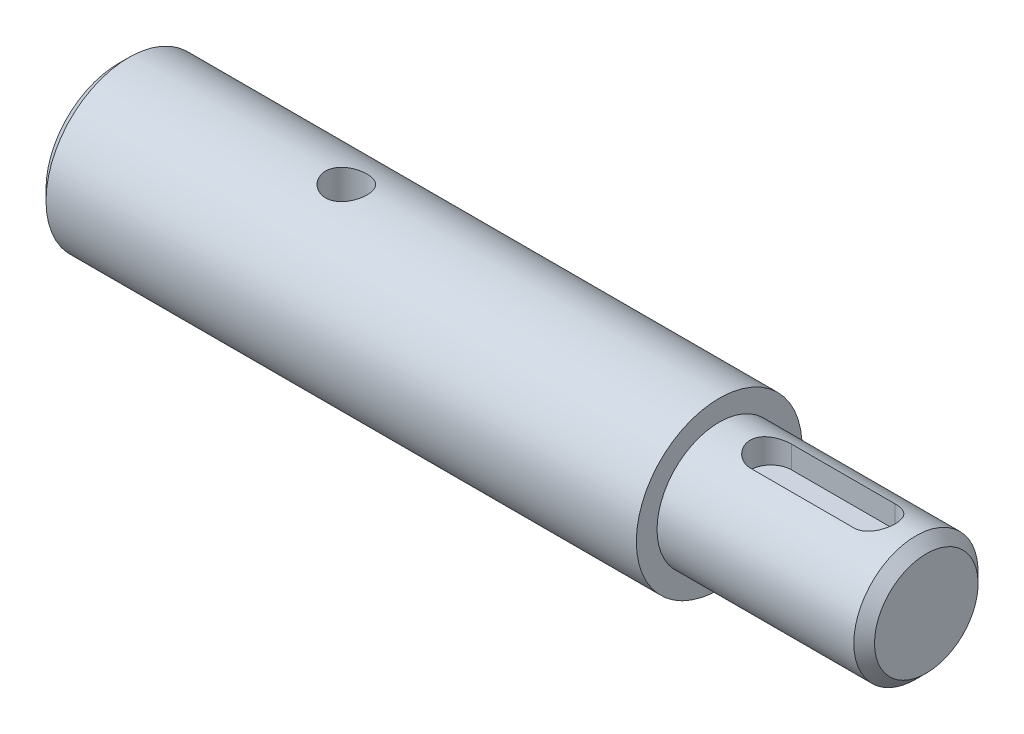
ISO-10303-21;
HEADER;
FILE_DESCRIPTION(('STEP AP214'),'2;1');
FILE_NAME('part.step','',(''),(''),'','','');
FILE_SCHEMA(('AUTOMOTIVE_DESIGN { 1 0 10303 214 1 1 1 1 }'));
ENDSEC;
DATA;
#1=APPLICATION_CONTEXT('core data for automotive mechanical design processes');
#2=APPLICATION_PROTOCOL_DEFINITION('international standard','automotive_design',2000,#1);
#3=PRODUCT_CONTEXT('',#1,'mechanical');
#4=PRODUCT('Part','Part','',(#3));
#5=PRODUCT_RELATED_PRODUCT_CATEGORY('part','',(#4));
#6=PRODUCT_DEFINITION_FORMATION('','',#4);
#7=PRODUCT_DEFINITION_CONTEXT('part definition',#1,'design');
#8=PRODUCT_DEFINITION('design','',#6,#7);
#9=PRODUCT_DEFINITION_SHAPE('','',#8);
#10=(LENGTH_UNIT() NAMED_UNIT(*) SI_UNIT(.MILLI.,.METRE.));
#11=(NAMED_UNIT(*) PLANE_ANGLE_UNIT() SI_UNIT($,.RADIAN.));
#12=(NAMED_UNIT(*) SI_UNIT($,.STERADIAN.) SOLID_ANGLE_UNIT());
#13=UNCERTAINTY_MEASURE_WITH_UNIT(LENGTH_MEASURE(1.E-05),#10,'distance_accuracy_value','');
#14=(GEOMETRIC_REPRESENTATION_CONTEXT(3) GLOBAL_UNCERTAINTY_ASSIGNED_CONTEXT((#13)) GLOBAL_UNIT_ASSIGNED_CONTEXT((#10,
#11,#12)) REPRESENTATION_CONTEXT('',''));
#15=CARTESIAN_POINT('',(0.,0.,0.));
#16=DIRECTION('',(0.,0.,1.));
#17=DIRECTION('',(1.,0.,0.));
#18=AXIS2_PLACEMENT_3D('',#15,#16,#17);
#19=CARTESIAN_POINT('',(0.,0.,0.));
#20=DIRECTION('',(-1.,0.,0.));
#21=DIRECTION('',(0.,0.,1.));
#22=AXIS2_PLACEMENT_3D('',#19,#20,#21);
#23=CYLINDRICAL_SURFACE('',#22,8.);
#24=CARTESIAN_POINT('',(58.,0.,0.));
#25=DIRECTION('',(-1.,0.,0.));
#26=DIRECTION('',(0.,0.,1.));
#27=AXIS2_PLACEMENT_3D('',#24,#25,#26);
#28=CIRCLE('',#27,8.);
#29=CARTESIAN_POINT('',(58.,0.,8.00000000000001));
#30=VERTEX_POINT('',#29);
#31=EDGE_CURVE('E111',#30,#30,#28,.T.);
#32=ORIENTED_EDGE('',*,*,#31,.T.);
#33=EDGE_LOOP('',(#32));
#34=FACE_BOUND('',#33,.T.);
#35=CARTESIAN_POINT('',(1.,0.,0.));
#36=DIRECTION('',(-1.,0.,0.));
#37=DIRECTION('',(0.,0.,1.));
#38=AXIS2_PLACEMENT_3D('',#35,#36,#37);
#39=CIRCLE('',#38,8.);
#40=CARTESIAN_POINT('',(1.,0.,8.00000000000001));
#41=VERTEX_POINT('',#40);
#42=EDGE_CURVE('E114',#41,#41,#39,.T.);
#43=ORIENTED_EDGE('',*,*,#42,.F.);
#44=EDGE_LOOP('',(#43));
#45=FACE_BOUND('',#44,.T.);
#46=CARTESIAN_POINT('',(22.,7.74596669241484,-2.00000000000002));
#47=CARTESIAN_POINT('',(21.8895593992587,7.74596880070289,-1.99999686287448));
#48=CARTESIAN_POINT('',(21.7790840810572,7.74835444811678,-1.99082099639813));
#49=CARTESIAN_POINT('',(21.5613059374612,7.75761489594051,-1.95441850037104));
#50=CARTESIAN_POINT('',(21.4540049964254,7.76449230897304,-1.9271813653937));
#51=CARTESIAN_POINT('',(21.2457571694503,7.78190979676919,-1.85559295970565));
#52=CARTESIAN_POINT('',(21.1448022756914,7.79244514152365,-1.81126378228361));
#53=CARTESIAN_POINT('',(20.9517513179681,7.81598553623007,-1.70681691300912));
#54=CARTESIAN_POINT('',(20.8596556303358,7.82899069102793,-1.64669855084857));
#55=CARTESIAN_POINT('',(20.6849106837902,7.85632573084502,-1.51096674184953));
#56=CARTESIAN_POINT('',(20.6024851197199,7.87067678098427,-1.43506951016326));
#57=CARTESIAN_POINT('',(20.4513908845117,7.89890300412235,-1.27054565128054));
#58=CARTESIAN_POINT('',(20.3827234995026,7.91277813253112,-1.18191783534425));
#59=CARTESIAN_POINT('',(20.260179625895,7.93872332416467,-0.992916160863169));
#60=CARTESIAN_POINT('',(20.2065228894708,7.95076549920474,-0.892395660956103));
#61=CARTESIAN_POINT('',(20.1169522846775,7.97144649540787,-0.683410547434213));
#62=CARTESIAN_POINT('',(20.0810357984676,7.98008581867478,-0.574947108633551));
#63=CARTESIAN_POINT('',(20.0286817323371,7.99283807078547,-0.355487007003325));
#64=CARTESIAN_POINT('',(20.0118642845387,7.99703915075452,-0.244586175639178));
#65=CARTESIAN_POINT('',(19.9969932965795,8.00074875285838,-0.0214630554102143));
#66=CARTESIAN_POINT('',(19.9989369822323,8.00025796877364,0.0907590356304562));
#67=CARTESIAN_POINT('',(20.0212598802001,7.99470475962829,0.310704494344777));
#68=CARTESIAN_POINT('',(20.0412290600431,7.989744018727,0.418472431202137));
#69=CARTESIAN_POINT('',(20.0983770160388,7.97592669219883,0.629076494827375));
#70=CARTESIAN_POINT('',(20.1355567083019,7.96706989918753,0.731912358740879));
#71=CARTESIAN_POINT('',(20.2264020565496,7.94630007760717,0.930813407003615));
#72=CARTESIAN_POINT('',(20.2802136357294,7.93436015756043,1.02680901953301));
#73=CARTESIAN_POINT('',(20.402684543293,7.90871923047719,1.20855124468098));
#74=CARTESIAN_POINT('',(20.4713464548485,7.89501791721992,1.29429607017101));
#75=CARTESIAN_POINT('',(20.6237669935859,7.86690971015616,1.45554807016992));
#76=CARTESIAN_POINT('',(20.7078839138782,7.85249375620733,1.5307153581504));
#77=CARTESIAN_POINT('',(20.8876799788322,7.82492034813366,1.66595275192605));
#78=CARTESIAN_POINT('',(20.9833596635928,7.81176295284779,1.72602215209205));
#79=CARTESIAN_POINT('',(21.1842320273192,7.78816397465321,1.82957625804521));
#80=CARTESIAN_POINT('',(21.2894685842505,7.77773586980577,1.87297913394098));
#81=CARTESIAN_POINT('',(21.5060683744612,7.76094912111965,1.94137124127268));
#82=CARTESIAN_POINT('',(21.6174302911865,7.75458960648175,1.96636441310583));
#83=CARTESIAN_POINT('',(21.8399676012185,7.74684284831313,1.99666371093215));
#84=CARTESIAN_POINT('',(21.9510702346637,7.74532871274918,2.0024723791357));
#85=CARTESIAN_POINT('',(22.1726575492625,7.74709874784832,1.99561359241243));
#86=CARTESIAN_POINT('',(22.283142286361,7.75038247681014,1.98294783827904));
#87=CARTESIAN_POINT('',(22.4984914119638,7.76125665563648,1.93994037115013));
#88=CARTESIAN_POINT('',(22.6034181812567,7.76877576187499,1.90989125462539));
#89=CARTESIAN_POINT('',(22.8067451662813,7.78720574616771,1.83329446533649));
#90=CARTESIAN_POINT('',(22.9051446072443,7.79811702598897,1.78674483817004));
#91=CARTESIAN_POINT('',(23.0947530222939,7.82236909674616,1.67741653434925));
#92=CARTESIAN_POINT('',(23.1857830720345,7.83575334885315,1.61433740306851));
#93=CARTESIAN_POINT('',(23.3561506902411,7.86333666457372,1.47412058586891));
#94=CARTESIAN_POINT('',(23.43548633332,7.87753586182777,1.39698058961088));
#95=CARTESIAN_POINT('',(23.5822488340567,7.90557922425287,1.22852544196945));
#96=CARTESIAN_POINT('',(23.649328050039,7.91940561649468,1.13690390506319));
#97=CARTESIAN_POINT('',(23.767148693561,7.94477773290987,0.943405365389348));
#98=CARTESIAN_POINT('',(23.8178909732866,7.9563235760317,0.841528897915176));
#99=CARTESIAN_POINT('',(23.9011568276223,7.97576092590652,0.631116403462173));
#100=CARTESIAN_POINT('',(23.9338114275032,7.98367864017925,0.522634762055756));
#101=CARTESIAN_POINT('',(23.9803682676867,7.99508234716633,0.301499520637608));
#102=CARTESIAN_POINT('',(23.9942741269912,7.99856919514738,0.188846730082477));
#103=CARTESIAN_POINT('',(24.0027351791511,8.00068338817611,-0.0341670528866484));
#104=CARTESIAN_POINT('',(23.9978034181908,7.99943957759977,-0.144507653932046));
#105=CARTESIAN_POINT('',(23.9699043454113,7.99251792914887,-0.362734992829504));
#106=CARTESIAN_POINT('',(23.9469375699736,7.98684022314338,-0.470621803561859));
#107=CARTESIAN_POINT('',(23.8838955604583,7.97170865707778,-0.68034207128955));
#108=CARTESIAN_POINT('',(23.8439130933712,7.96227529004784,-0.782204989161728));
#109=CARTESIAN_POINT('',(23.7480588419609,7.94062577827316,-0.977834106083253));
#110=CARTESIAN_POINT('',(23.692185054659,7.92840928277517,-1.07159928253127));
#111=CARTESIAN_POINT('',(23.5645695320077,7.90214499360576,-1.25080385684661));
#112=CARTESIAN_POINT('',(23.4924797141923,7.8880603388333,-1.33598997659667));
#113=CARTESIAN_POINT('',(23.3351542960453,7.85981298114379,-1.49323004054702));
#114=CARTESIAN_POINT('',(23.2499153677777,7.84565025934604,-1.5652806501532));
#115=CARTESIAN_POINT('',(23.0667971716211,7.81854951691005,-1.69552405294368));
#116=CARTESIAN_POINT('',(22.9687117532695,7.80563927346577,-1.75343323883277));
#117=CARTESIAN_POINT('',(22.7638890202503,7.78287910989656,-1.85185379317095));
#118=CARTESIAN_POINT('',(22.6571580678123,7.77302696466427,-1.89237781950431));
#119=CARTESIAN_POINT('',(22.4588459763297,7.75903817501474,-1.94884505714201));
#120=CARTESIAN_POINT('',(22.3682136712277,7.75417326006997,-1.96798634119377));
#121=CARTESIAN_POINT('',(22.1850622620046,7.7476367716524,-1.99356458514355));
#122=CARTESIAN_POINT('',(22.0925433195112,7.74596492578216,-2.00000262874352));
#123=CARTESIAN_POINT('',(22.,7.74596669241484,-2.00000000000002));
#124=B_SPLINE_CURVE_WITH_KNOTS('',3,(#46,#47,#48,#49,#50,#51,#52,#53,#54,#55,#56,#57,#58,#59,
#60,#61,#62,#63,#64,#65,#66,#67,#68,#69,#70,#71,#72,#73,#74,#75,#76,#77,#78,#79,#80,#81,#82,#83,
#84,#85,#86,#87,#88,#89,#90,#91,#92,#93,#94,#95,#96,#97,#98,#99,#100,#101,#102,#103,#104,#105,
#106,#107,#108,#109,#110,#111,#112,#113,#114,#115,#116,#117,#118,#119,#120,#121,#122,#123),
.UNSPECIFIED.,.T.,.F.,(4,2,2,2,2,2,2,2,2,2,2,2,2,2,2,2,2,2,2,2,2,2,2,2,2,2,2,2,2,2,2,2,2,2,2,2,
2,2,4),(0.,0.330981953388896,0.662156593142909,0.992904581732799,1.32366661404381,
1.66099163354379,1.99834817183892,2.34041197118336,2.68242527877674,3.01751000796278,
3.35254518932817,3.68014610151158,4.00776445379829,4.33834299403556,4.66897908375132,
5.0085637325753,5.34816424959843,5.68941145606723,6.0305856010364,6.36274859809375,
6.69488101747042,7.02157924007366,7.34831617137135,7.68146276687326,8.01466415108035,
8.35620264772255,8.69772332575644,9.03673658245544,9.37568439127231,9.70546756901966,
10.0352409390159,10.3632390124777,10.6912784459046,11.0271767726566,11.3631602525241,
11.7054118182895,12.0474137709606,12.3247826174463,12.6021278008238),.UNSPECIFIED.);
#125=CARTESIAN_POINT('',(22.,7.74596669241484,-2.00000000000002));
#126=VERTEX_POINT('',#125);
#127=EDGE_CURVE('E29',#126,#126,#124,.T.);
#128=ORIENTED_EDGE('',*,*,#127,.F.);
#129=EDGE_LOOP('',(#128));
#130=FACE_BOUND('',#129,.T.);
#131=ADVANCED_FACE('F25',(#34,#45,#130),#23,.T.);
#132=CARTESIAN_POINT('',(0.,0.,0.));
#133=DIRECTION('',(-1.,0.,0.));
#134=DIRECTION('',(0.,0.,1.));
#135=AXIS2_PLACEMENT_3D('',#132,#133,#134);
#136=CYLINDRICAL_SURFACE('',#135,6.);
#137=CARTESIAN_POINT('',(77.,0.,0.));
#138=DIRECTION('',(-1.,0.,0.));
#139=DIRECTION('',(0.,0.,1.));
#140=AXIS2_PLACEMENT_3D('',#137,#138,#139);
#141=CIRCLE('',#140,6.);
#142=CARTESIAN_POINT('',(77.,0.,6.));
#143=VERTEX_POINT('',#142);
#144=EDGE_CURVE('E105',#143,#143,#141,.T.);
#145=ORIENTED_EDGE('',*,*,#144,.T.);
#146=EDGE_LOOP('',(#145));
#147=FACE_BOUND('',#146,.T.);
#148=CARTESIAN_POINT('',(58.,0.,0.));
#149=DIRECTION('',(-1.,0.,0.));
#150=DIRECTION('',(0.,0.,1.));
#151=AXIS2_PLACEMENT_3D('',#148,#149,#150);
#152=CIRCLE('',#151,6.);
#153=CARTESIAN_POINT('',(58.,0.,6.00000000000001));
#154=VERTEX_POINT('',#153);
#155=EDGE_CURVE('E108',#154,#154,#152,.T.);
#156=ORIENTED_EDGE('',*,*,#155,.F.);
#157=EDGE_LOOP('',(#156));
#158=FACE_BOUND('',#157,.T.);
#159=DIRECTION('',(-1.,0.,0.));
#160=VECTOR('',#159,1.);
#161=CARTESIAN_POINT('',(0.,5.65685424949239,2.00000000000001));
#162=LINE('',#161,#160);
#163=CARTESIAN_POINT('',(63.,5.6568542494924,1.99999999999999));
#164=VERTEX_POINT('',#163);
#165=CARTESIAN_POINT('',(73.,5.6568542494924,1.99999999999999));
#166=VERTEX_POINT('',#165);
#167=EDGE_CURVE('E11',#164,#166,#162,.F.);
#168=ORIENTED_EDGE('',*,*,#167,.F.);
#169=CARTESIAN_POINT('',(63.,5.65685424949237,-2.00000000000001));
#170=CARTESIAN_POINT('',(62.8910636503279,5.65685389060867,-2.00000051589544));
#171=CARTESIAN_POINT('',(62.7821304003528,5.66003538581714,-1.99106956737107));
#172=CARTESIAN_POINT('',(62.5674911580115,5.67235148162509,-1.95570226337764));
#173=CARTESIAN_POINT('',(62.4617857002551,5.68148706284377,-1.92926302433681));
#174=CARTESIAN_POINT('',(62.2567462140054,5.70456407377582,-1.85991097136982));
#175=CARTESIAN_POINT('',(62.1574001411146,5.71849607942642,-1.81703044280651));
#176=CARTESIAN_POINT('',(61.9672799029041,5.74958244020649,-1.71612325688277));
#177=CARTESIAN_POINT('',(61.8765076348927,5.76673750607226,-1.65809325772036));
#178=CARTESIAN_POINT('',(61.7025600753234,5.80308978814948,-1.52610229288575));
#179=CARTESIAN_POINT('',(61.6197691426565,5.82233789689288,-1.45164868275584));
#180=CARTESIAN_POINT('',(61.4675863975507,5.86027729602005,-1.2899753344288));
#181=CARTESIAN_POINT('',(61.3981967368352,5.87896849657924,-1.20275355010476));
#182=CARTESIAN_POINT('',(61.2730422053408,5.91427733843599,-1.01520901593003));
#183=CARTESIAN_POINT('',(61.2176800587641,5.93082815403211,-0.914603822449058));
#184=CARTESIAN_POINT('',(61.124816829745,5.95939173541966,-0.704862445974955));
#185=CARTESIAN_POINT('',(61.0873109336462,5.97140572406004,-0.595728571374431));
#186=CARTESIAN_POINT('',(61.0325282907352,5.98918150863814,-0.376057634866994));
#187=CARTESIAN_POINT('',(61.014593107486,5.99514629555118,-0.265701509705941));
#188=CARTESIAN_POINT('',(60.9973674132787,6.00087216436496,-0.0433957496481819));
#189=CARTESIAN_POINT('',(60.9980720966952,6.00063484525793,0.0685534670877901));
#190=CARTESIAN_POINT('',(61.0176885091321,5.99412079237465,0.286207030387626));
#191=CARTESIAN_POINT('',(61.035885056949,5.98808129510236,0.391984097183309));
#192=CARTESIAN_POINT('',(61.0887859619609,5.97093934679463,0.598886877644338));
#193=CARTESIAN_POINT('',(61.1234914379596,5.95983655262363,0.700012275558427));
#194=CARTESIAN_POINT('',(61.2088426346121,5.93351340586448,0.896304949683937));
#195=CARTESIAN_POINT('',(61.259691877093,5.91824085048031,0.991376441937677));
#196=CARTESIAN_POINT('',(61.3757194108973,5.88516786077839,1.17184865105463));
#197=CARTESIAN_POINT('',(61.4409016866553,5.86736672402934,1.25724666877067));
#198=CARTESIAN_POINT('',(61.5873487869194,5.83012383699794,1.42020173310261));
#199=CARTESIAN_POINT('',(61.669226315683,5.81064430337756,1.49720031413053));
#200=CARTESIAN_POINT('',(61.8448974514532,5.77294670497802,1.63655451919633));
#201=CARTESIAN_POINT('',(61.9386928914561,5.75472883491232,1.69890788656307));
#202=CARTESIAN_POINT('',(62.1373072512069,5.72141050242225,1.80797491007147));
#203=CARTESIAN_POINT('',(62.2422642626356,5.70635818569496,1.85445292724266));
#204=CARTESIAN_POINT('',(62.4591427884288,5.6816330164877,1.92888638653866));
#205=CARTESIAN_POINT('',(62.5710613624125,5.67195790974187,1.95684959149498));
#206=CARTESIAN_POINT('',(62.7932767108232,5.65959272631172,1.99232256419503));
#207=CARTESIAN_POINT('',(62.9034188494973,5.65660720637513,2.00069819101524));
#208=CARTESIAN_POINT('',(63.1235522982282,5.65713344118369,1.99921087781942));
#209=CARTESIAN_POINT('',(63.233543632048,5.6606440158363,1.98935125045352));
#210=CARTESIAN_POINT('',(63.4463139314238,5.673472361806,1.95245130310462));
#211=CARTESIAN_POINT('',(63.5492108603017,5.68258650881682,1.92601278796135));
#212=CARTESIAN_POINT('',(63.7490872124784,5.70537107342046,1.85742772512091));
#213=CARTESIAN_POINT('',(63.8460655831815,5.71904229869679,1.81527839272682));
#214=CARTESIAN_POINT('',(64.034760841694,5.74993755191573,1.71494868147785));
#215=CARTESIAN_POINT('',(64.1262132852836,5.76726051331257,1.65630223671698));
#216=CARTESIAN_POINT('',(64.2982921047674,5.80331537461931,1.52517126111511));
#217=CARTESIAN_POINT('',(64.3789152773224,5.82204768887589,1.45268265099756));
#218=CARTESIAN_POINT('',(64.5310559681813,5.85990077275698,1.29178341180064));
#219=CARTESIAN_POINT('',(64.6019487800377,5.87899687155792,1.20277454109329));
#220=CARTESIAN_POINT('',(64.7278322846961,5.91453703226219,1.01365458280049));
#221=CARTESIAN_POINT('',(64.7828235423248,5.93098118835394,0.913543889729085));
#222=CARTESIAN_POINT('',(64.8748402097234,5.95928811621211,0.705559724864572));
#223=CARTESIAN_POINT('',(64.9119825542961,5.97118060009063,0.597742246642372));
#224=CARTESIAN_POINT('',(64.9674554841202,5.98917221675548,0.37691693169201));
#225=CARTESIAN_POINT('',(64.985792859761,5.99527344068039,0.263910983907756));
#226=CARTESIAN_POINT('',(65.0025241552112,6.00083726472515,0.0416306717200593));
#227=CARTESIAN_POINT('',(65.0018149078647,6.00059840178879,-0.0675694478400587));
#228=CARTESIAN_POINT('',(64.9826853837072,5.99424393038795,-0.284222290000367));
#229=CARTESIAN_POINT('',(64.9642665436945,5.98812879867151,-0.391675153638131));
#230=CARTESIAN_POINT('',(64.9108355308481,5.97081829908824,-0.600084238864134));
#231=CARTESIAN_POINT('',(64.8760915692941,5.95970516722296,-0.701116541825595));
#232=CARTESIAN_POINT('',(64.7912449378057,5.93354321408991,-0.895956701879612));
#233=CARTESIAN_POINT('',(64.741139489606,5.91849368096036,-0.98976324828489));
#234=CARTESIAN_POINT('',(64.624860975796,5.88531737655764,-1.1712680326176));
#235=CARTESIAN_POINT('',(64.5581626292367,5.86709744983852,-1.25861250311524));
#236=CARTESIAN_POINT('',(64.4114852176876,5.82985977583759,-1.42116205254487));
#237=CARTESIAN_POINT('',(64.3315019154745,5.81084177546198,-1.4963632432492));
#238=CARTESIAN_POINT('',(64.1567812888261,5.773265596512,-1.63548361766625));
#239=CARTESIAN_POINT('',(64.0615889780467,5.75475455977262,-1.69884593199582));
#240=CARTESIAN_POINT('',(63.8613311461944,5.72120386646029,-1.80862868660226));
#241=CARTESIAN_POINT('',(63.7562682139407,5.70616330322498,-1.85505355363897));
#242=CARTESIAN_POINT('',(63.5440763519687,5.6820266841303,-1.92768765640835));
#243=CARTESIAN_POINT('',(63.4372554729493,5.67269265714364,-1.95471581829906));
#244=CARTESIAN_POINT('',(63.2202878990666,5.66010767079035,-1.99086864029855));
#245=CARTESIAN_POINT('',(63.1101423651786,5.65685461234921,-1.9999994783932));
#246=CARTESIAN_POINT('',(63.,5.65685424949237,-2.00000000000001));
#247=B_SPLINE_CURVE_WITH_KNOTS('',3,(#169,#170,#171,#172,#173,#174,#175,#176,#177,#178,#179,
#180,#181,#182,#183,#184,#185,#186,#187,#188,#189,#190,#191,#192,#193,#194,#195,#196,#197,#198,
#199,#200,#201,#202,#203,#204,#205,#206,#207,#208,#209,#210,#211,#212,#213,#214,#215,#216,#217,
#218,#219,#220,#221,#222,#223,#224,#225,#226,#227,#228,#229,#230,#231,#232,#233,#234,#235,#236,
#237,#238,#239,#240,#241,#242,#243,#244,#245,#246),.UNSPECIFIED.,.T.,.F.,(4,2,2,2,2,2,2,2,2,2,2,
2,2,2,2,2,2,2,2,2,2,2,2,2,2,2,2,2,2,2,2,2,2,2,2,2,2,2,4),(0.,0.326401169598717,
0.652856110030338,0.978673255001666,1.30456233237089,1.64202674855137,1.97954530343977,
2.32587012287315,2.67210152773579,3.0062863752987,3.34038506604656,3.66138009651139,
3.98239688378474,4.30763309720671,4.63295983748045,4.97360348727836,5.31429959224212,
5.65985279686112,6.00526102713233,6.33508582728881,6.66485071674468,6.98328791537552,
7.3017815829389,7.63037715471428,7.95906971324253,8.30357616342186,8.64807037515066,
8.99027582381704,9.33235766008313,9.65836169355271,9.98433928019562,10.3051391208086,
10.6259970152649,10.9587103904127,11.2915300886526,11.6373780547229,11.9831355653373,
12.3132642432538,12.6432789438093),.UNSPECIFIED.);
#248=CARTESIAN_POINT('',(63.,5.65685424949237,-2.00000000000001));
#249=VERTEX_POINT('',#248);
#250=EDGE_CURVE('E38',#249,#164,#247,.T.);
#251=ORIENTED_EDGE('',*,*,#250,.F.);
#252=DIRECTION('',(-1.,0.,0.));
#253=VECTOR('',#252,1.);
#254=CARTESIAN_POINT('',(0.,5.65685424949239,-2.));
#255=LINE('',#254,#253);
#256=CARTESIAN_POINT('',(73.,5.65685424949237,-2.00000000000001));
#257=VERTEX_POINT('',#256);
#258=EDGE_CURVE('E120',#257,#249,#255,.T.);
#259=ORIENTED_EDGE('',*,*,#258,.F.);
#260=CARTESIAN_POINT('',(73.,5.65685424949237,-2.00000000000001));
#261=CARTESIAN_POINT('',(72.8910636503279,5.65685389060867,-2.00000051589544));
#262=CARTESIAN_POINT('',(72.7821304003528,5.66003538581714,-1.99106956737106));
#263=CARTESIAN_POINT('',(72.5674911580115,5.67235148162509,-1.95570226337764));
#264=CARTESIAN_POINT('',(72.4617857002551,5.68148706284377,-1.92926302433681));
#265=CARTESIAN_POINT('',(72.2567462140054,5.70456407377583,-1.85991097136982));
#266=CARTESIAN_POINT('',(72.1574001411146,5.71849607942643,-1.8170304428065));
#267=CARTESIAN_POINT('',(71.9672799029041,5.74958244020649,-1.71612325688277));
#268=CARTESIAN_POINT('',(71.8765076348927,5.76673750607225,-1.65809325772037));
#269=CARTESIAN_POINT('',(71.7025600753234,5.80308978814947,-1.52610229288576));
#270=CARTESIAN_POINT('',(71.6197691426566,5.82233789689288,-1.45164868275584));
#271=CARTESIAN_POINT('',(71.4675863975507,5.86027729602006,-1.2899753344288));
#272=CARTESIAN_POINT('',(71.3981967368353,5.87896849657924,-1.20275355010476));
#273=CARTESIAN_POINT('',(71.2730422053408,5.91427733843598,-1.01520901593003));
#274=CARTESIAN_POINT('',(71.2176800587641,5.93082815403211,-0.914603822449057));
#275=CARTESIAN_POINT('',(71.124816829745,5.95939173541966,-0.704862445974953));
#276=CARTESIAN_POINT('',(71.0873109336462,5.97140572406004,-0.59572857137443));
#277=CARTESIAN_POINT('',(71.0325282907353,5.98918150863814,-0.376057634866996));
#278=CARTESIAN_POINT('',(71.014593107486,5.99514629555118,-0.265701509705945));
#279=CARTESIAN_POINT('',(70.9973674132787,6.00087216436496,-0.0433957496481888));
#280=CARTESIAN_POINT('',(70.9980720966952,6.00063484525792,0.0685534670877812));
#281=CARTESIAN_POINT('',(71.0176885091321,5.99412079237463,0.286207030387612));
#282=CARTESIAN_POINT('',(71.035885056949,5.98808129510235,0.391984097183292));
#283=CARTESIAN_POINT('',(71.088785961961,5.97093934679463,0.598886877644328));
#284=CARTESIAN_POINT('',(71.1234914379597,5.95983655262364,0.700012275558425));
#285=CARTESIAN_POINT('',(71.2088426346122,5.9335134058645,0.896304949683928));
#286=CARTESIAN_POINT('',(71.2596918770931,5.91824085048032,0.991376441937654));
#287=CARTESIAN_POINT('',(71.3757194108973,5.88516786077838,1.17184865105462));
#288=CARTESIAN_POINT('',(71.4409016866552,5.86736672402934,1.25724666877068));
#289=CARTESIAN_POINT('',(71.5873487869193,5.83012383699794,1.42020173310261));
#290=CARTESIAN_POINT('',(71.6692263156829,5.81064430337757,1.49720031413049));
#291=CARTESIAN_POINT('',(71.8448974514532,5.77294670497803,1.63655451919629));
#292=CARTESIAN_POINT('',(71.9386928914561,5.75472883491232,1.69890788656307));
#293=CARTESIAN_POINT('',(72.1373072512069,5.72141050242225,1.80797491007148));
#294=CARTESIAN_POINT('',(72.2422642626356,5.70635818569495,1.85445292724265));
#295=CARTESIAN_POINT('',(72.4591427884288,5.68163301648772,1.92888638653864));
#296=CARTESIAN_POINT('',(72.5710613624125,5.67195790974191,1.95684959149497));
#297=CARTESIAN_POINT('',(72.7932767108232,5.65959272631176,1.99232256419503));
#298=CARTESIAN_POINT('',(72.9034188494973,5.65660720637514,2.00069819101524));
#299=CARTESIAN_POINT('',(73.1235522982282,5.65713344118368,1.99921087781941));
#300=CARTESIAN_POINT('',(73.233543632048,5.66064401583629,1.98935125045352));
#301=CARTESIAN_POINT('',(73.4463139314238,5.673472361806,1.95245130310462));
#302=CARTESIAN_POINT('',(73.5492108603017,5.68258650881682,1.92601278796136));
#303=CARTESIAN_POINT('',(73.7490872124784,5.70537107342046,1.85742772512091));
#304=CARTESIAN_POINT('',(73.8460655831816,5.71904229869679,1.81527839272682));
#305=CARTESIAN_POINT('',(74.034760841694,5.74993755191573,1.71494868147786));
#306=CARTESIAN_POINT('',(74.1262132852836,5.76726051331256,1.65630223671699));
#307=CARTESIAN_POINT('',(74.2982921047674,5.80331537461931,1.52517126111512));
#308=CARTESIAN_POINT('',(74.3789152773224,5.82204768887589,1.45268265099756));
#309=CARTESIAN_POINT('',(74.5310559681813,5.85990077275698,1.29178341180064));
#310=CARTESIAN_POINT('',(74.6019487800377,5.87899687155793,1.2027745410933));
#311=CARTESIAN_POINT('',(74.7278322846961,5.91453703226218,1.01365458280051));
#312=CARTESIAN_POINT('',(74.7828235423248,5.9309811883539,0.913543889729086));
#313=CARTESIAN_POINT('',(74.8748402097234,5.95928811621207,0.705559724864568));
#314=CARTESIAN_POINT('',(74.9119825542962,5.97118060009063,0.597742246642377));
#315=CARTESIAN_POINT('',(74.9674554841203,5.98917221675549,0.376916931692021));
#316=CARTESIAN_POINT('',(74.985792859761,5.99527344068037,0.263910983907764));
#317=CARTESIAN_POINT('',(75.0025241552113,6.00083726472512,0.0416306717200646));
#318=CARTESIAN_POINT('',(75.0018149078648,6.00059840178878,-0.0675694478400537));
#319=CARTESIAN_POINT('',(74.9826853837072,5.99424393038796,-0.284222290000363));
#320=CARTESIAN_POINT('',(74.9642665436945,5.98812879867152,-0.391675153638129));
#321=CARTESIAN_POINT('',(74.9108355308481,5.97081829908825,-0.600084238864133));
#322=CARTESIAN_POINT('',(74.8760915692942,5.95970516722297,-0.701116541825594));
#323=CARTESIAN_POINT('',(74.7912449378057,5.9335432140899,-0.895956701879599));
#324=CARTESIAN_POINT('',(74.741139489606,5.91849368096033,-0.989763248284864));
#325=CARTESIAN_POINT('',(74.624860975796,5.88531737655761,-1.17126803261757));
#326=CARTESIAN_POINT('',(74.5581626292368,5.86709744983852,-1.25861250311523));
#327=CARTESIAN_POINT('',(74.4114852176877,5.82985977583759,-1.42116205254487));
#328=CARTESIAN_POINT('',(74.3315019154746,5.81084177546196,-1.49636324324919));
#329=CARTESIAN_POINT('',(74.1567812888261,5.77326559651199,-1.63548361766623));
#330=CARTESIAN_POINT('',(74.0615889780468,5.75475455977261,-1.69884593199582));
#331=CARTESIAN_POINT('',(73.8613311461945,5.7212038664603,-1.80862868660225));
#332=CARTESIAN_POINT('',(73.7562682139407,5.70616330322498,-1.85505355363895));
#333=CARTESIAN_POINT('',(73.5440763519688,5.68202668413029,-1.92768765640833));
#334=CARTESIAN_POINT('',(73.4372554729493,5.67269265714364,-1.95471581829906));
#335=CARTESIAN_POINT('',(73.2202878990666,5.66010767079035,-1.99086864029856));
#336=CARTESIAN_POINT('',(73.1101423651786,5.65685461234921,-1.9999994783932));
#337=CARTESIAN_POINT('',(73.,5.65685424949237,-2.00000000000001));
#338=B_SPLINE_CURVE_WITH_KNOTS('',3,(#260,#261,#262,#263,#264,#265,#266,#267,#268,#269,#270,
#271,#272,#273,#274,#275,#276,#277,#278,#279,#280,#281,#282,#283,#284,#285,#286,#287,#288,#289,
#290,#291,#292,#293,#294,#295,#296,#297,#298,#299,#300,#301,#302,#303,#304,#305,#306,#307,#308,
#309,#310,#311,#312,#313,#314,#315,#316,#317,#318,#319,#320,#321,#322,#323,#324,#325,#326,#327,
#328,#329,#330,#331,#332,#333,#334,#335,#336,#337),.UNSPECIFIED.,.T.,.F.,(4,2,2,2,2,2,2,2,2,2,2,
2,2,2,2,2,2,2,2,2,2,2,2,2,2,2,2,2,2,2,2,2,2,2,2,2,2,2,4),(0.,0.326401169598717,
0.652856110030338,0.978673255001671,1.30456233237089,1.64202674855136,1.97954530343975,
2.32587012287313,2.67210152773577,3.00628637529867,3.34038506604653,3.66138009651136,
3.98239688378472,4.30763309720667,4.63295983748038,4.97360348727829,5.31429959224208,
5.65985279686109,6.0052610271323,6.33508582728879,6.66485071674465,6.98328791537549,
7.30178158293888,7.63037715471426,7.95906971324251,8.30357616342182,8.64807037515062,
8.99027582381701,9.33235766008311,9.65836169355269,9.9843392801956,10.3051391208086,
10.6259970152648,10.9587103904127,11.2915300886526,11.6373780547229,11.9831355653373,
12.3132642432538,12.6432789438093),.UNSPECIFIED.);
#339=EDGE_CURVE('E122',#166,#257,#338,.T.);
#340=ORIENTED_EDGE('',*,*,#339,.F.);
#341=EDGE_LOOP('',(#168,#251,#259,#340));
#342=FACE_BOUND('',#341,.T.);
#343=ADVANCED_FACE('F131',(#147,#158,#342),#136,.T.);
#344=CARTESIAN_POINT('',(0.,0.,0.));
#345=DIRECTION('',(1.,0.,0.));
#346=DIRECTION('',(0.,0.,-1.));
#347=AXIS2_PLACEMENT_3D('',#344,#345,#346);
#348=PLANE('',#347);
#349=CARTESIAN_POINT('',(0.,0.,0.));
#350=DIRECTION('',(-1.,0.,0.));
#351=DIRECTION('',(0.,0.,1.));
#352=AXIS2_PLACEMENT_3D('',#349,#350,#351);
#353=CIRCLE('',#352,7.);
#354=CARTESIAN_POINT('',(0.,0.,7.00000000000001));
#355=VERTEX_POINT('',#354);
#356=EDGE_CURVE('E117',#355,#355,#353,.T.);
#357=ORIENTED_EDGE('',*,*,#356,.T.);
#358=EDGE_LOOP('',(#357));
#359=FACE_BOUND('',#358,.T.);
#360=ADVANCED_FACE('F27',(#359),#348,.F.);
#361=CARTESIAN_POINT('',(1.,0.,0.));
#362=DIRECTION('',(1.,0.,0.));
#363=DIRECTION('',(0.,0.,-1.));
#364=AXIS2_PLACEMENT_3D('',#361,#362,#363);
#365=CONICAL_SURFACE('',#364,8.,0.785398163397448);
#366=ORIENTED_EDGE('',*,*,#356,.F.);
#367=EDGE_LOOP('',(#366));
#368=FACE_BOUND('',#367,.T.);
#369=ORIENTED_EDGE('',*,*,#42,.T.);
#370=EDGE_LOOP('',(#369));
#371=FACE_BOUND('',#370,.T.);
#372=ADVANCED_FACE('F160',(#368,#371),#365,.T.);
#373=CARTESIAN_POINT('',(58.,8.00000000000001,0.));
#374=DIRECTION('',(-1.,0.,0.));
#375=DIRECTION('',(0.,0.,1.));
#376=AXIS2_PLACEMENT_3D('',#373,#374,#375);
#377=PLANE('',#376);
#378=ORIENTED_EDGE('',*,*,#31,.F.);
#379=EDGE_LOOP('',(#378));
#380=FACE_BOUND('',#379,.T.);
#381=ORIENTED_EDGE('',*,*,#155,.T.);
#382=EDGE_LOOP('',(#381));
#383=FACE_BOUND('',#382,.T.);
#384=ADVANCED_FACE('F155',(#380,#383),#377,.F.);
#385=CARTESIAN_POINT('',(78.,0.,0.));
#386=DIRECTION('',(-1.,0.,0.));
#387=DIRECTION('',(0.,0.,1.));
#388=AXIS2_PLACEMENT_3D('',#385,#386,#387);
#389=CONICAL_SURFACE('',#388,5.,0.785398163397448);
#390=ORIENTED_EDGE('',*,*,#144,.F.);
#391=EDGE_LOOP('',(#390));
#392=FACE_BOUND('',#391,.T.);
#393=CARTESIAN_POINT('',(78.,0.,0.));
#394=DIRECTION('',(-1.,0.,0.));
#395=DIRECTION('',(0.,0.,1.));
#396=AXIS2_PLACEMENT_3D('',#393,#394,#395);
#397=CIRCLE('',#396,5.);
#398=CARTESIAN_POINT('',(78.,0.,5.));
#399=VERTEX_POINT('',#398);
#400=EDGE_CURVE('E102',#399,#399,#397,.T.);
#401=ORIENTED_EDGE('',*,*,#400,.T.);
#402=EDGE_LOOP('',(#401));
#403=FACE_BOUND('',#402,.T.);
#404=ADVANCED_FACE('F152',(#392,#403),#389,.T.);
#405=CARTESIAN_POINT('',(78.,4.99999999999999,0.));
#406=DIRECTION('',(-1.,0.,0.));
#407=DIRECTION('',(0.,0.,1.));
#408=AXIS2_PLACEMENT_3D('',#405,#406,#407);
#409=PLANE('',#408);
#410=ORIENTED_EDGE('',*,*,#400,.F.);
#411=EDGE_LOOP('',(#410));
#412=FACE_BOUND('',#411,.T.);
#413=ADVANCED_FACE('F146',(#412),#409,.F.);
#414=CARTESIAN_POINT('',(63.,7.99999999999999,1.99999999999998));
#415=DIRECTION('',(0.,0.,-1.));
#416=DIRECTION('',(-1.,0.,0.));
#417=AXIS2_PLACEMENT_3D('',#414,#415,#416);
#418=PLANE('',#417);
#419=ORIENTED_EDGE('',*,*,#167,.T.);
#420=DIRECTION('',(0.,-1.,0.));
#421=VECTOR('',#420,1.);
#422=CARTESIAN_POINT('',(73.,7.99999999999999,1.99999999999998));
#423=LINE('',#422,#421);
#424=CARTESIAN_POINT('',(73.0000000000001,3.50000000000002,1.99999999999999));
#425=VERTEX_POINT('',#424);
#426=EDGE_CURVE('E98',#166,#425,#423,.T.);
#427=ORIENTED_EDGE('',*,*,#426,.T.);
#428=DIRECTION('',(1.,0.,0.));
#429=VECTOR('',#428,1.);
#430=CARTESIAN_POINT('',(63.,3.5,1.99999999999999));
#431=LINE('',#430,#429);
#432=CARTESIAN_POINT('',(63.,3.5,1.99999999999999));
#433=VERTEX_POINT('',#432);
#434=EDGE_CURVE('E86',#433,#425,#431,.T.);
#435=ORIENTED_EDGE('',*,*,#434,.F.);
#436=DIRECTION('',(0.,-1.,0.));
#437=VECTOR('',#436,1.);
#438=CARTESIAN_POINT('',(63.,7.99999999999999,1.99999999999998));
#439=LINE('',#438,#437);
#440=EDGE_CURVE('E100',#164,#433,#439,.T.);
#441=ORIENTED_EDGE('',*,*,#440,.F.);
#442=EDGE_LOOP('',(#419,#427,#435,#441));
#443=FACE_BOUND('',#442,.T.);
#444=ADVANCED_FACE('F144',(#443),#418,.T.);
#445=CARTESIAN_POINT('',(63.,7.99999999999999,0.));
#446=DIRECTION('',(0.,-1.,0.));
#447=DIRECTION('',(0.,0.,-1.));
#448=AXIS2_PLACEMENT_3D('',#445,#446,#447);
#449=CYLINDRICAL_SURFACE('',#448,2.);
#450=ORIENTED_EDGE('',*,*,#250,.T.);
#451=ORIENTED_EDGE('',*,*,#440,.T.);
#452=CARTESIAN_POINT('',(63.,3.5,0.));
#453=DIRECTION('',(0.,1.,0.));
#454=DIRECTION('',(0.,0.,1.));
#455=AXIS2_PLACEMENT_3D('',#452,#453,#454);
#456=CIRCLE('',#455,2.);
#457=CARTESIAN_POINT('',(63.,3.5,-2.00000000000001));
#458=VERTEX_POINT('',#457);
#459=EDGE_CURVE('E82',#458,#433,#456,.T.);
#460=ORIENTED_EDGE('',*,*,#459,.F.);
#461=DIRECTION('',(0.,-1.,0.));
#462=VECTOR('',#461,1.);
#463=CARTESIAN_POINT('',(63.,7.99999999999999,-2.00000000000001));
#464=LINE('',#463,#462);
#465=EDGE_CURVE('E95',#249,#458,#464,.T.);
#466=ORIENTED_EDGE('',*,*,#465,.F.);
#467=EDGE_LOOP('',(#450,#451,#460,#466));
#468=FACE_BOUND('',#467,.T.);
#469=ADVANCED_FACE('F141',(#468),#449,.F.);
#470=CARTESIAN_POINT('',(73.,7.99999999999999,0.));
#471=DIRECTION('',(0.,-1.,0.));
#472=DIRECTION('',(0.,0.,-1.));
#473=AXIS2_PLACEMENT_3D('',#470,#471,#472);
#474=CYLINDRICAL_SURFACE('',#473,2.);
#475=ORIENTED_EDGE('',*,*,#339,.T.);
#476=DIRECTION('',(0.,-1.,0.));
#477=VECTOR('',#476,1.);
#478=CARTESIAN_POINT('',(73.,7.99999999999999,-2.00000000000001));
#479=LINE('',#478,#477);
#480=CARTESIAN_POINT('',(73.,3.49999999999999,-2.00000000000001));
#481=VERTEX_POINT('',#480);
#482=EDGE_CURVE('E45',#257,#481,#479,.T.);
#483=ORIENTED_EDGE('',*,*,#482,.T.);
#484=CARTESIAN_POINT('',(73.0000000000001,3.50000000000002,0.));
#485=DIRECTION('',(0.,1.,0.));
#486=DIRECTION('',(0.,0.,-1.));
#487=AXIS2_PLACEMENT_3D('',#484,#485,#486);
#488=CIRCLE('',#487,2.);
#489=EDGE_CURVE('E89',#425,#481,#488,.T.);
#490=ORIENTED_EDGE('',*,*,#489,.F.);
#491=ORIENTED_EDGE('',*,*,#426,.F.);
#492=EDGE_LOOP('',(#475,#483,#490,#491));
#493=FACE_BOUND('',#492,.T.);
#494=ADVANCED_FACE('F135',(#493),#474,.F.);
#495=CARTESIAN_POINT('',(63.,7.99999999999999,-2.00000000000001));
#496=DIRECTION('',(0.,0.,1.));
#497=DIRECTION('',(1.,0.,0.));
#498=AXIS2_PLACEMENT_3D('',#495,#496,#497);
#499=PLANE('',#498);
#500=ORIENTED_EDGE('',*,*,#258,.T.);
#501=ORIENTED_EDGE('',*,*,#465,.T.);
#502=DIRECTION('',(-1.,0.,0.));
#503=VECTOR('',#502,1.);
#504=CARTESIAN_POINT('',(63.,3.5,-2.00000000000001));
#505=LINE('',#504,#503);
#506=EDGE_CURVE('E92',#481,#458,#505,.T.);
#507=ORIENTED_EDGE('',*,*,#506,.F.);
#508=ORIENTED_EDGE('',*,*,#482,.F.);
#509=EDGE_LOOP('',(#500,#501,#507,#508));
#510=FACE_BOUND('',#509,.T.);
#511=ADVANCED_FACE('F140',(#510),#499,.T.);
#512=CARTESIAN_POINT('',(63.,3.5,0.));
#513=DIRECTION('',(0.,1.,0.));
#514=DIRECTION('',(0.,0.,1.));
#515=AXIS2_PLACEMENT_3D('',#512,#513,#514);
#516=PLANE('',#515);
#517=ORIENTED_EDGE('',*,*,#459,.T.);
#518=ORIENTED_EDGE('',*,*,#434,.T.);
#519=ORIENTED_EDGE('',*,*,#489,.T.);
#520=ORIENTED_EDGE('',*,*,#506,.T.);
#521=EDGE_LOOP('',(#517,#518,#519,#520));
#522=FACE_BOUND('',#521,.T.);
#523=ADVANCED_FACE('F186',(#522),#516,.T.);
#524=CARTESIAN_POINT('',(22.,0.,0.));
#525=DIRECTION('',(0.,-1.,0.));
#526=DIRECTION('',(0.,0.,-1.));
#527=AXIS2_PLACEMENT_3D('',#524,#525,#526);
#528=CYLINDRICAL_SURFACE('',#527,2.);
#529=CARTESIAN_POINT('',(22.,-0.845299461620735,0.));
#530=DIRECTION('',(0.,-1.,0.));
#531=DIRECTION('',(0.,0.,-1.));
#532=AXIS2_PLACEMENT_3D('',#529,#530,#531);
#533=CIRCLE('',#532,2.00000000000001);
#534=CARTESIAN_POINT('',(22.,-0.845299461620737,-2.00000000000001));
#535=VERTEX_POINT('',#534);
#536=EDGE_CURVE('E78',#535,#535,#533,.T.);
#537=ORIENTED_EDGE('',*,*,#536,.T.);
#538=EDGE_LOOP('',(#537));
#539=FACE_BOUND('',#538,.T.);
#540=ORIENTED_EDGE('',*,*,#127,.T.);
#541=EDGE_LOOP('',(#540));
#542=FACE_BOUND('',#541,.T.);
#543=ADVANCED_FACE('F74',(#539,#542),#528,.F.);
#544=CARTESIAN_POINT('',(22.,-0.845299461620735,0.));
#545=DIRECTION('',(0.,1.,0.));
#546=DIRECTION('',(0.,0.,1.));
#547=AXIS2_PLACEMENT_3D('',#544,#545,#546);
#548=CONICAL_SURFACE('',#547,2.00000000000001,1.04719755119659);
#549=CARTESIAN_POINT('',(22.,-1.99999999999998,0.));
#550=VERTEX_POINT('',#549);
#551=VERTEX_LOOP('',#550);
#552=FACE_BOUND('',#551,.T.);
#553=ORIENTED_EDGE('',*,*,#536,.F.);
#554=EDGE_LOOP('',(#553));
#555=FACE_BOUND('',#554,.T.);
#556=ADVANCED_FACE('F71',(#552,#555),#548,.F.);
#557=CLOSED_SHELL('',(#131,#343,#360,#372,#384,#404,#413,#444,#469,#494,#511,#523,#543,#556));
#558=MANIFOLD_SOLID_BREP('B2',#557);
#559=ADVANCED_BREP_SHAPE_REPRESENTATION('',(#18,#558),#14);
#560=SHAPE_DEFINITION_REPRESENTATION(#9,#559);
ENDSEC;
END-ISO-10303-21;
